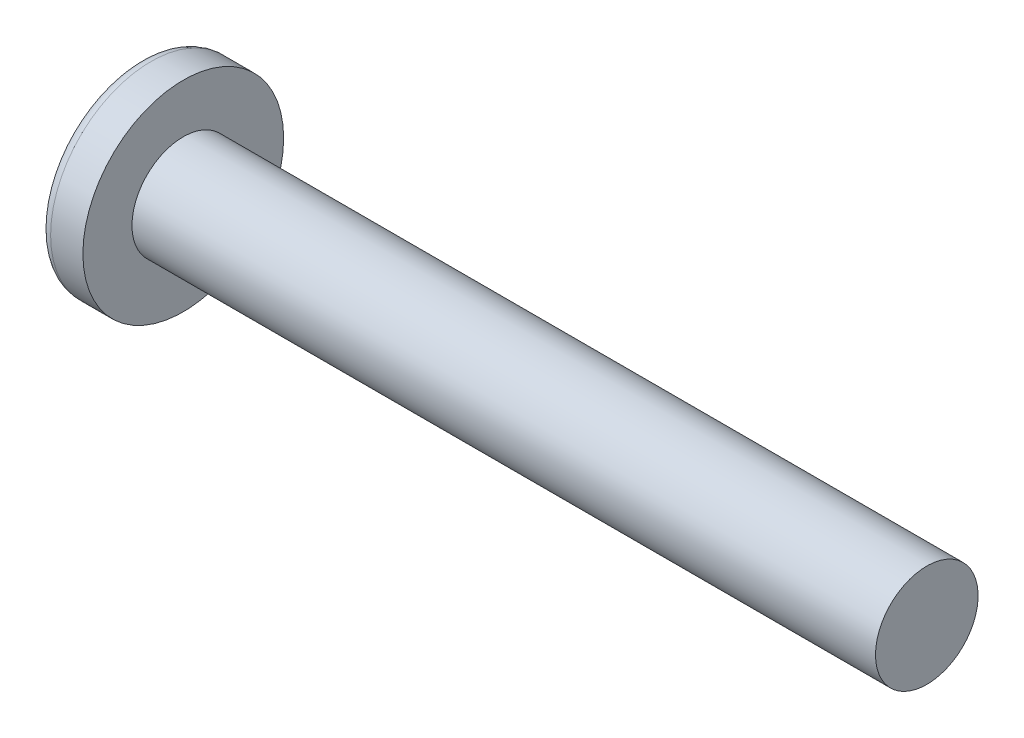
from build123d import *

# Parameters (mm, degrees)
CIRPATTERN1_COUNT = 2
CIRPATTERN1_ANGLE = 90


with BuildPart() as part:
    # BodySke → Base-Revolve (revolve)
    with BuildSketch(Plane.XY, mode=Mode.PRIVATE) as base_revolve_sk:
        with BuildLine():
            Line((2.4638, 1.7526), (2.4638, 3.429))
            Line((2.4638, 3.429), (1.361607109, 3.429))
            ThreePointArc((1.361607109, 3.429), (1.187654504, 3.386971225), (1.05207993, 3.270157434))
            ThreePointArc((1.05207993, 3.270157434), (0.269494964, 1.717614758), (0, 0))
            Line((0, 0), (27.8638, 0))
            Line((27.8638, 0), (27.8638, 1.7526))
            Line((27.8638, 1.7526), (2.4638, 1.7526))
        make_face()
    revolve(base_revolve_sk.sketch.rotate(Axis((-25.4, 0, 0), (1, 0, 0)), 90), axis=Axis((-25.4, 0, 0), (1, 0, 0)))

    # Sketch3 → Cut-Loft1 section 0
    with BuildSketch(Plane(origin=(0, 0, 0), x_dir=(0, 0, -1), z_dir=(1, 0, 0))):
        with BuildLine():
            Line((0.4699, -2.2352), (-0.4699, -2.2352))
            Line((-0.4699, -2.2352), (-0.4699, 2.2352))
            Line((-0.4699, 2.2352), (0.4699, 2.2352))
            Line((0.4699, 2.2352), (0.4699, -2.2352))
        make_face()
    # Sketch4 → Cut-Loft1 section 1
    with BuildSketch(Plane(origin=(2.4384, 0, 0), x_dir=(0, 0, -1), z_dir=(1, 0, 0))):
        with BuildLine():
            Line((0.23495, -0.23495), (-0.23495, -0.23495))
            Line((-0.23495, -0.23495), (-0.23495, 0.23495))
            Line((-0.23495, 0.23495), (0.23495, 0.23495))
            Line((0.23495, 0.23495), (0.23495, -0.23495))
        make_face()
    cut_loft1 = loft(mode=Mode.SUBTRACT)

    # CirPattern1: Cut-Loft1 ×2 about axis
    cirpattern1_axis = Axis((0, 0, 0), (1, 0, 0))
    for i in range(1, CIRPATTERN1_COUNT):
        add(cut_loft1.rotate(cirpattern1_axis, i * CIRPATTERN1_ANGLE / (CIRPATTERN1_COUNT - 1)), mode=Mode.SUBTRACT)


solid = part.part
